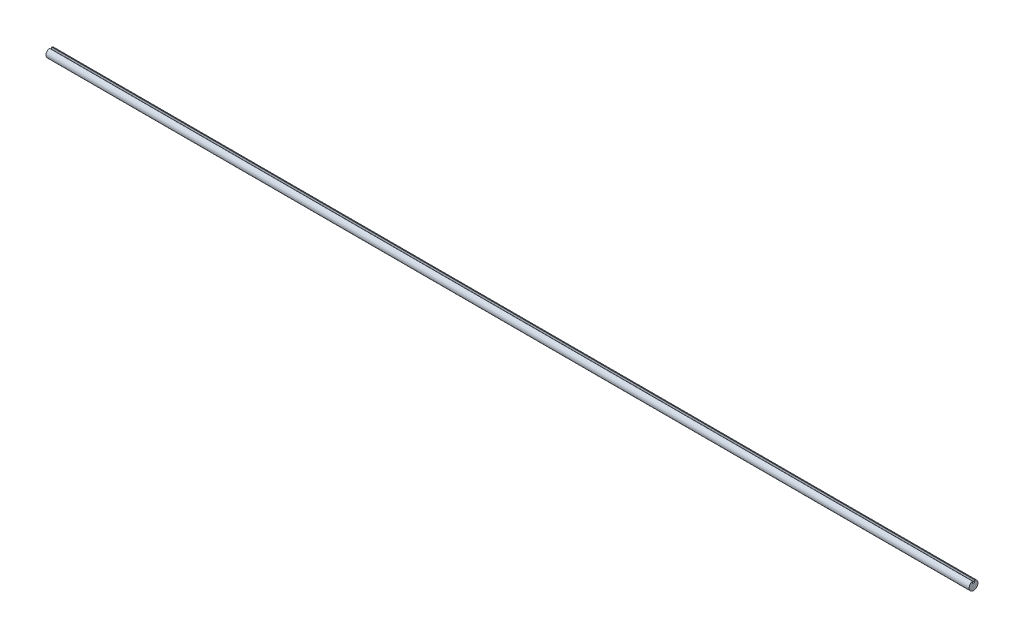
from build123d import *

# Parameters (mm, degrees)
BOSS_EXTRUDE1_DEPTH = 660.4


with BuildPart() as part:
    # Sketch1 → Boss-Extrude1 (new, symmetric)
    with BuildSketch(Plane(origin=(0, 0, 0), x_dir=(0, 0, -1), z_dir=(1, 0, 0))):
        with BuildLine():
            Line((-1.5875, 6.148361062), (-1.5875, 3.175))
            Line((-1.5875, 3.175), (1.5875, 3.175))
            Line((1.5875, 3.175), (1.5875, 6.148361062))
            ThreePointArc((1.5875, 6.148361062), (0, -6.35), (-1.5875, 6.148361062))
        make_face()
    extrude(amount=BOSS_EXTRUDE1_DEPTH, both=True)


solid = part.part
